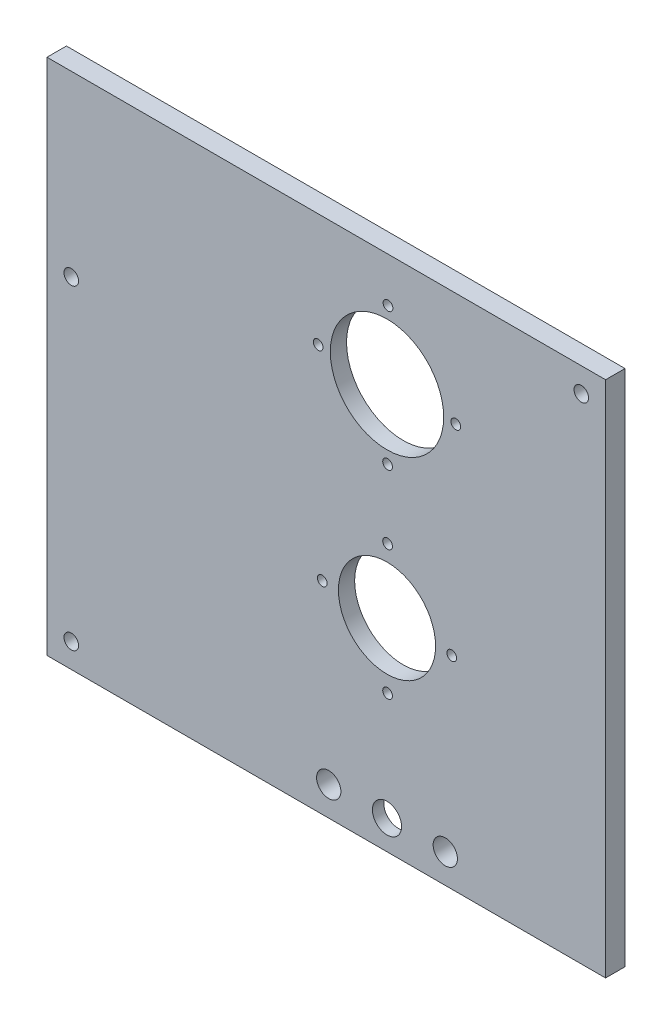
ISO-10303-21;
HEADER;
FILE_DESCRIPTION(('STEP AP214'),'2;1');
FILE_NAME('part.step','',(''),(''),'','','');
FILE_SCHEMA(('AUTOMOTIVE_DESIGN { 1 0 10303 214 1 1 1 1 }'));
ENDSEC;
DATA;
#1=APPLICATION_CONTEXT('core data for automotive mechanical design processes');
#2=APPLICATION_PROTOCOL_DEFINITION('international standard','automotive_design',2000,#1);
#3=PRODUCT_CONTEXT('',#1,'mechanical');
#4=PRODUCT('Part','Part','',(#3));
#5=PRODUCT_RELATED_PRODUCT_CATEGORY('part','',(#4));
#6=PRODUCT_DEFINITION_FORMATION('','',#4);
#7=PRODUCT_DEFINITION_CONTEXT('part definition',#1,'design');
#8=PRODUCT_DEFINITION('design','',#6,#7);
#9=PRODUCT_DEFINITION_SHAPE('','',#8);
#10=(LENGTH_UNIT() NAMED_UNIT(*) SI_UNIT(.MILLI.,.METRE.));
#11=(NAMED_UNIT(*) PLANE_ANGLE_UNIT() SI_UNIT($,.RADIAN.));
#12=(NAMED_UNIT(*) SI_UNIT($,.STERADIAN.) SOLID_ANGLE_UNIT());
#13=UNCERTAINTY_MEASURE_WITH_UNIT(LENGTH_MEASURE(1.E-05),#10,'distance_accuracy_value','');
#14=(GEOMETRIC_REPRESENTATION_CONTEXT(3) GLOBAL_UNCERTAINTY_ASSIGNED_CONTEXT((#13)) GLOBAL_UNIT_ASSIGNED_CONTEXT((#10,
#11,#12)) REPRESENTATION_CONTEXT('',''));
#15=CARTESIAN_POINT('',(0.,0.,0.));
#16=DIRECTION('',(0.,0.,1.));
#17=DIRECTION('',(1.,0.,0.));
#18=AXIS2_PLACEMENT_3D('',#15,#16,#17);
#19=CARTESIAN_POINT('',(70.,-262.,0.));
#20=DIRECTION('',(0.,0.,1.));
#21=DIRECTION('',(1.,0.,0.));
#22=AXIS2_PLACEMENT_3D('',#19,#20,#21);
#23=CYLINDRICAL_SURFACE('',#22,9.);
#24=CARTESIAN_POINT('',(70.,-262.,12.));
#25=DIRECTION('',(0.,0.,1.));
#26=DIRECTION('',(1.,0.,0.));
#27=AXIS2_PLACEMENT_3D('',#24,#25,#26);
#28=CIRCLE('',#27,9.);
#29=CARTESIAN_POINT('',(79.,-262.,12.));
#30=VERTEX_POINT('',#29);
#31=EDGE_CURVE('E195',#30,#30,#28,.T.);
#32=ORIENTED_EDGE('',*,*,#31,.T.);
#33=EDGE_LOOP('',(#32));
#34=FACE_BOUND('',#33,.T.);
#35=CARTESIAN_POINT('',(70.,-262.,5.));
#36=DIRECTION('',(0.,0.,-1.));
#37=DIRECTION('',(-1.,0.,0.));
#38=AXIS2_PLACEMENT_3D('',#35,#36,#37);
#39=CIRCLE('',#38,9.);
#40=CARTESIAN_POINT('',(61.,-262.,5.));
#41=VERTEX_POINT('',#40);
#42=EDGE_CURVE('E36',#41,#41,#39,.F.);
#43=ORIENTED_EDGE('',*,*,#42,.F.);
#44=EDGE_LOOP('',(#43));
#45=FACE_BOUND('',#44,.T.);
#46=ADVANCED_FACE('F32',(#34,#45),#23,.F.);
#47=CARTESIAN_POINT('',(70.,-155.,12.));
#48=DIRECTION('',(0.,0.,-1.));
#49=DIRECTION('',(-1.,0.,0.));
#50=AXIS2_PLACEMENT_3D('',#47,#48,#49);
#51=CYLINDRICAL_SURFACE('',#50,30.);
#52=CARTESIAN_POINT('',(70.,-155.,12.));
#53=DIRECTION('',(0.,0.,1.));
#54=DIRECTION('',(1.,0.,0.));
#55=AXIS2_PLACEMENT_3D('',#52,#53,#54);
#56=CIRCLE('',#55,30.);
#57=CARTESIAN_POINT('',(100.,-155.,12.));
#58=VERTEX_POINT('',#57);
#59=EDGE_CURVE('E232',#58,#58,#56,.T.);
#60=ORIENTED_EDGE('',*,*,#59,.T.);
#61=EDGE_LOOP('',(#60));
#62=FACE_BOUND('',#61,.T.);
#63=CARTESIAN_POINT('',(70.,-155.,2.));
#64=DIRECTION('',(0.,0.,-1.));
#65=DIRECTION('',(-1.,0.,0.));
#66=AXIS2_PLACEMENT_3D('',#63,#64,#65);
#67=CIRCLE('',#66,30.);
#68=CARTESIAN_POINT('',(40.,-155.,2.));
#69=VERTEX_POINT('',#68);
#70=EDGE_CURVE('E154',#69,#69,#67,.T.);
#71=ORIENTED_EDGE('',*,*,#70,.T.);
#72=EDGE_LOOP('',(#71));
#73=FACE_BOUND('',#72,.T.);
#74=ADVANCED_FACE('F347',(#62,#73),#51,.F.);
#75=CARTESIAN_POINT('',(70.,-30.,12.));
#76=DIRECTION('',(0.,0.,-1.));
#77=DIRECTION('',(-1.,0.,0.));
#78=AXIS2_PLACEMENT_3D('',#75,#76,#77);
#79=CYLINDRICAL_SURFACE('',#78,35.);
#80=CARTESIAN_POINT('',(70.,-30.,12.));
#81=DIRECTION('',(0.,0.,1.));
#82=DIRECTION('',(1.,0.,0.));
#83=AXIS2_PLACEMENT_3D('',#80,#81,#82);
#84=CIRCLE('',#83,35.);
#85=CARTESIAN_POINT('',(105.,-30.,12.));
#86=VERTEX_POINT('',#85);
#87=EDGE_CURVE('E229',#86,#86,#84,.T.);
#88=ORIENTED_EDGE('',*,*,#87,.T.);
#89=EDGE_LOOP('',(#88));
#90=FACE_BOUND('',#89,.T.);
#91=CARTESIAN_POINT('',(70.,-30.,2.));
#92=DIRECTION('',(0.,0.,-1.));
#93=DIRECTION('',(-1.,0.,0.));
#94=AXIS2_PLACEMENT_3D('',#91,#92,#93);
#95=CIRCLE('',#94,35.);
#96=CARTESIAN_POINT('',(35.,-30.,2.));
#97=VERTEX_POINT('',#96);
#98=EDGE_CURVE('E149',#97,#97,#95,.T.);
#99=ORIENTED_EDGE('',*,*,#98,.T.);
#100=EDGE_LOOP('',(#99));
#101=FACE_BOUND('',#100,.T.);
#102=ADVANCED_FACE('F296',(#90,#101),#79,.F.);
#103=CARTESIAN_POINT('',(-140.,40.,12.));
#104=DIRECTION('',(0.,0.,-1.));
#105=DIRECTION('',(-1.,0.,0.));
#106=AXIS2_PLACEMENT_3D('',#103,#104,#105);
#107=PLANE('',#106);
#108=CARTESIAN_POINT('',(106.,-262.,12.));
#109=DIRECTION('',(0.,0.,1.));
#110=DIRECTION('',(1.,0.,0.));
#111=AXIS2_PLACEMENT_3D('',#108,#109,#110);
#112=CIRCLE('',#111,7.50000000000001);
#113=CARTESIAN_POINT('',(113.5,-262.,12.));
#114=VERTEX_POINT('',#113);
#115=EDGE_CURVE('E268',#114,#114,#112,.T.);
#116=ORIENTED_EDGE('',*,*,#115,.F.);
#117=EDGE_LOOP('',(#116));
#118=FACE_BOUND('',#117,.T.);
#119=CARTESIAN_POINT('',(34.,-262.,12.));
#120=DIRECTION('',(0.,0.,1.));
#121=DIRECTION('',(1.,0.,0.));
#122=AXIS2_PLACEMENT_3D('',#119,#120,#121);
#123=CIRCLE('',#122,7.5);
#124=CARTESIAN_POINT('',(41.5,-262.,12.));
#125=VERTEX_POINT('',#124);
#126=EDGE_CURVE('E279',#125,#125,#123,.T.);
#127=ORIENTED_EDGE('',*,*,#126,.F.);
#128=EDGE_LOOP('',(#127));
#129=FACE_BOUND('',#128,.T.);
#130=ORIENTED_EDGE('',*,*,#31,.F.);
#131=EDGE_LOOP('',(#130));
#132=FACE_BOUND('',#131,.T.);
#133=CARTESIAN_POINT('',(70.6097344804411,12.5,12.));
#134=DIRECTION('',(0.,0.,1.));
#135=DIRECTION('',(1.,0.,0.));
#136=AXIS2_PLACEMENT_3D('',#133,#134,#135);
#137=CIRCLE('',#136,2.99999999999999);
#138=CARTESIAN_POINT('',(73.6097344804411,12.5,12.));
#139=VERTEX_POINT('',#138);
#140=EDGE_CURVE('E189',#139,#139,#137,.T.);
#141=ORIENTED_EDGE('',*,*,#140,.F.);
#142=EDGE_LOOP('',(#141));
#143=FACE_BOUND('',#142,.T.);
#144=CARTESIAN_POINT('',(70.358898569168,-72.5,12.));
#145=DIRECTION('',(0.,0.,1.));
#146=DIRECTION('',(1.,0.,0.));
#147=AXIS2_PLACEMENT_3D('',#144,#145,#146);
#148=CIRCLE('',#147,2.99999999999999);
#149=CARTESIAN_POINT('',(73.358898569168,-72.5,12.));
#150=VERTEX_POINT('',#149);
#151=EDGE_CURVE('E186',#150,#150,#148,.T.);
#152=ORIENTED_EDGE('',*,*,#151,.F.);
#153=EDGE_LOOP('',(#152));
#154=FACE_BOUND('',#153,.T.);
#155=CARTESIAN_POINT('',(112.5,-30.,12.));
#156=DIRECTION('',(0.,0.,1.));
#157=DIRECTION('',(1.,0.,0.));
#158=AXIS2_PLACEMENT_3D('',#155,#156,#157);
#159=CIRCLE('',#158,2.99999999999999);
#160=CARTESIAN_POINT('',(115.5,-30.,12.));
#161=VERTEX_POINT('',#160);
#162=EDGE_CURVE('E183',#161,#161,#159,.T.);
#163=ORIENTED_EDGE('',*,*,#162,.F.);
#164=EDGE_LOOP('',(#163));
#165=FACE_BOUND('',#164,.T.);
#166=CARTESIAN_POINT('',(27.5,-30.,12.));
#167=DIRECTION('',(0.,0.,1.));
#168=DIRECTION('',(1.,0.,0.));
#169=AXIS2_PLACEMENT_3D('',#166,#167,#168);
#170=CIRCLE('',#169,2.99999999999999);
#171=CARTESIAN_POINT('',(30.5,-30.,12.));
#172=VERTEX_POINT('',#171);
#173=EDGE_CURVE('E179',#172,#172,#170,.T.);
#174=ORIENTED_EDGE('',*,*,#173,.F.);
#175=EDGE_LOOP('',(#174));
#176=FACE_BOUND('',#175,.T.);
#177=CARTESIAN_POINT('',(110.,-155.,12.));
#178=DIRECTION('',(0.,0.,1.));
#179=DIRECTION('',(1.,0.,0.));
#180=AXIS2_PLACEMENT_3D('',#177,#178,#179);
#181=CIRCLE('',#180,2.99999999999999);
#182=CARTESIAN_POINT('',(113.,-155.,12.));
#183=VERTEX_POINT('',#182);
#184=EDGE_CURVE('E175',#183,#183,#181,.T.);
#185=ORIENTED_EDGE('',*,*,#184,.F.);
#186=EDGE_LOOP('',(#185));
#187=FACE_BOUND('',#186,.T.);
#188=CARTESIAN_POINT('',(70.358898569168,-195.,12.));
#189=DIRECTION('',(0.,0.,1.));
#190=DIRECTION('',(1.,0.,0.));
#191=AXIS2_PLACEMENT_3D('',#188,#189,#190);
#192=CIRCLE('',#191,2.99999999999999);
#193=CARTESIAN_POINT('',(73.358898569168,-195.,12.));
#194=VERTEX_POINT('',#193);
#195=EDGE_CURVE('E171',#194,#194,#192,.T.);
#196=ORIENTED_EDGE('',*,*,#195,.F.);
#197=EDGE_LOOP('',(#196));
#198=FACE_BOUND('',#197,.T.);
#199=CARTESIAN_POINT('',(30.,-155.,12.));
#200=DIRECTION('',(0.,0.,1.));
#201=DIRECTION('',(1.,0.,0.));
#202=AXIS2_PLACEMENT_3D('',#199,#200,#201);
#203=CIRCLE('',#202,2.99999999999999);
#204=CARTESIAN_POINT('',(33.,-155.,12.));
#205=VERTEX_POINT('',#204);
#206=EDGE_CURVE('E167',#205,#205,#203,.T.);
#207=ORIENTED_EDGE('',*,*,#206,.F.);
#208=EDGE_LOOP('',(#207));
#209=FACE_BOUND('',#208,.T.);
#210=CARTESIAN_POINT('',(70.358898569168,-115.,12.));
#211=DIRECTION('',(0.,0.,1.));
#212=DIRECTION('',(1.,0.,0.));
#213=AXIS2_PLACEMENT_3D('',#210,#211,#212);
#214=CIRCLE('',#213,2.99999999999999);
#215=CARTESIAN_POINT('',(73.358898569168,-115.,12.));
#216=VERTEX_POINT('',#215);
#217=EDGE_CURVE('E163',#216,#216,#214,.T.);
#218=ORIENTED_EDGE('',*,*,#217,.F.);
#219=EDGE_LOOP('',(#218));
#220=FACE_BOUND('',#219,.T.);
#221=ORIENTED_EDGE('',*,*,#87,.F.);
#222=EDGE_LOOP('',(#221));
#223=FACE_BOUND('',#222,.T.);
#224=CARTESIAN_POINT('',(-125.,-265.,12.));
#225=DIRECTION('',(0.,0.,1.));
#226=DIRECTION('',(1.,0.,0.));
#227=AXIS2_PLACEMENT_3D('',#224,#225,#226);
#228=CIRCLE('',#227,4.50000000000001);
#229=CARTESIAN_POINT('',(-120.5,-265.,12.));
#230=VERTEX_POINT('',#229);
#231=EDGE_CURVE('E238',#230,#230,#228,.T.);
#232=ORIENTED_EDGE('',*,*,#231,.F.);
#233=EDGE_LOOP('',(#232));
#234=FACE_BOUND('',#233,.T.);
#235=DIRECTION('',(-1.,0.,0.));
#236=VECTOR('',#235,1.);
#237=CARTESIAN_POINT('',(-140.,40.,12.));
#238=LINE('',#237,#236);
#239=CARTESIAN_POINT('',(205.,40.,12.));
#240=VERTEX_POINT('',#239);
#241=CARTESIAN_POINT('',(-140.,40.,12.));
#242=VERTEX_POINT('',#241);
#243=EDGE_CURVE('E130',#240,#242,#238,.T.);
#244=ORIENTED_EDGE('',*,*,#243,.T.);
#245=DIRECTION('',(0.,-1.,0.));
#246=VECTOR('',#245,1.);
#247=CARTESIAN_POINT('',(-140.,40.,12.));
#248=LINE('',#247,#246);
#249=CARTESIAN_POINT('',(-140.,-280.,12.));
#250=VERTEX_POINT('',#249);
#251=EDGE_CURVE('E137',#242,#250,#248,.T.);
#252=ORIENTED_EDGE('',*,*,#251,.T.);
#253=DIRECTION('',(1.,0.,0.));
#254=VECTOR('',#253,1.);
#255=CARTESIAN_POINT('',(-140.,-280.,12.));
#256=LINE('',#255,#254);
#257=CARTESIAN_POINT('',(205.,-280.,12.));
#258=VERTEX_POINT('',#257);
#259=EDGE_CURVE('E139',#250,#258,#256,.T.);
#260=ORIENTED_EDGE('',*,*,#259,.T.);
#261=DIRECTION('',(0.,1.,0.));
#262=VECTOR('',#261,1.);
#263=CARTESIAN_POINT('',(205.,40.,12.));
#264=LINE('',#263,#262);
#265=EDGE_CURVE('E57',#258,#240,#264,.T.);
#266=ORIENTED_EDGE('',*,*,#265,.T.);
#267=EDGE_LOOP('',(#244,#252,#260,#266));
#268=FACE_BOUND('',#267,.T.);
#269=CARTESIAN_POINT('',(190.,25.,12.));
#270=DIRECTION('',(0.,0.,1.));
#271=DIRECTION('',(1.,0.,0.));
#272=AXIS2_PLACEMENT_3D('',#269,#270,#271);
#273=CIRCLE('',#272,4.49999999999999);
#274=CARTESIAN_POINT('',(194.5,25.,12.));
#275=VERTEX_POINT('',#274);
#276=EDGE_CURVE('E244',#275,#275,#273,.T.);
#277=ORIENTED_EDGE('',*,*,#276,.F.);
#278=EDGE_LOOP('',(#277));
#279=FACE_BOUND('',#278,.T.);
#280=ORIENTED_EDGE('',*,*,#59,.F.);
#281=EDGE_LOOP('',(#280));
#282=FACE_BOUND('',#281,.T.);
#283=CARTESIAN_POINT('',(-125.,-70.,12.));
#284=DIRECTION('',(0.,0.,1.));
#285=DIRECTION('',(1.,0.,0.));
#286=AXIS2_PLACEMENT_3D('',#283,#284,#285);
#287=CIRCLE('',#286,4.50000000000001);
#288=CARTESIAN_POINT('',(-120.5,-70.,12.));
#289=VERTEX_POINT('',#288);
#290=EDGE_CURVE('E226',#289,#289,#287,.T.);
#291=ORIENTED_EDGE('',*,*,#290,.F.);
#292=EDGE_LOOP('',(#291));
#293=FACE_BOUND('',#292,.T.);
#294=ADVANCED_FACE('F259',(#118,#129,#132,#143,#154,#165,#176,#187,#198,#209,#220,#223,#234,
#268,#279,#282,#293),#107,.F.);
#295=CARTESIAN_POINT('',(-140.,40.,0.));
#296=DIRECTION('',(0.,0.,-1.));
#297=DIRECTION('',(-1.,0.,0.));
#298=AXIS2_PLACEMENT_3D('',#295,#296,#297);
#299=PLANE('',#298);
#300=DIRECTION('',(0.,-1.,0.));
#301=VECTOR('',#300,1.);
#302=CARTESIAN_POINT('',(88.,-262.,0.));
#303=LINE('',#302,#301);
#304=CARTESIAN_POINT('',(88.,-262.,0.));
#305=VERTEX_POINT('',#304);
#306=CARTESIAN_POINT('',(88.,-280.,0.));
#307=VERTEX_POINT('',#306);
#308=EDGE_CURVE('E617',#305,#307,#303,.T.);
#309=ORIENTED_EDGE('',*,*,#308,.F.);
#310=CARTESIAN_POINT('',(70.,-262.,0.));
#311=DIRECTION('',(0.,0.,-1.));
#312=DIRECTION('',(-1.,0.,0.));
#313=AXIS2_PLACEMENT_3D('',#310,#311,#312);
#314=CIRCLE('',#313,18.);
#315=CARTESIAN_POINT('',(52.,-262.,0.));
#316=VERTEX_POINT('',#315);
#317=EDGE_CURVE('E121',#316,#305,#314,.T.);
#318=ORIENTED_EDGE('',*,*,#317,.F.);
#319=DIRECTION('',(0.,1.,0.));
#320=VECTOR('',#319,1.);
#321=CARTESIAN_POINT('',(52.,-262.,0.));
#322=LINE('',#321,#320);
#323=CARTESIAN_POINT('',(52.,-280.,0.));
#324=VERTEX_POINT('',#323);
#325=EDGE_CURVE('E105',#324,#316,#322,.T.);
#326=ORIENTED_EDGE('',*,*,#325,.F.);
#327=DIRECTION('',(1.,0.,0.));
#328=VECTOR('',#327,1.);
#329=CARTESIAN_POINT('',(-140.,-280.,0.));
#330=LINE('',#329,#328);
#331=CARTESIAN_POINT('',(-140.,-280.,0.));
#332=VERTEX_POINT('',#331);
#333=EDGE_CURVE('E119',#332,#324,#330,.T.);
#334=ORIENTED_EDGE('',*,*,#333,.F.);
#335=DIRECTION('',(0.,-1.,0.));
#336=VECTOR('',#335,1.);
#337=CARTESIAN_POINT('',(-140.,40.,0.));
#338=LINE('',#337,#336);
#339=CARTESIAN_POINT('',(-140.,40.,0.));
#340=VERTEX_POINT('',#339);
#341=EDGE_CURVE('E132',#340,#332,#338,.T.);
#342=ORIENTED_EDGE('',*,*,#341,.F.);
#343=DIRECTION('',(-1.,0.,0.));
#344=VECTOR('',#343,1.);
#345=CARTESIAN_POINT('',(-140.,40.,0.));
#346=LINE('',#345,#344);
#347=CARTESIAN_POINT('',(205.,40.,0.));
#348=VERTEX_POINT('',#347);
#349=EDGE_CURVE('E246',#348,#340,#346,.T.);
#350=ORIENTED_EDGE('',*,*,#349,.F.);
#351=DIRECTION('',(0.,1.,0.));
#352=VECTOR('',#351,1.);
#353=CARTESIAN_POINT('',(205.,40.,0.));
#354=LINE('',#353,#352);
#355=CARTESIAN_POINT('',(205.,-280.,0.));
#356=VERTEX_POINT('',#355);
#357=EDGE_CURVE('E127',#356,#348,#354,.T.);
#358=ORIENTED_EDGE('',*,*,#357,.F.);
#359=EDGE_CURVE('E128',#307,#356,#330,.T.);
#360=ORIENTED_EDGE('',*,*,#359,.F.);
#361=EDGE_LOOP('',(#309,#318,#326,#334,#342,#350,#358,#360));
#362=FACE_BOUND('',#361,.T.);
#363=CARTESIAN_POINT('',(106.,-262.,0.));
#364=DIRECTION('',(0.,0.,1.));
#365=DIRECTION('',(1.,0.,0.));
#366=AXIS2_PLACEMENT_3D('',#363,#364,#365);
#367=CIRCLE('',#366,7.50000000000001);
#368=CARTESIAN_POINT('',(113.5,-262.,0.));
#369=VERTEX_POINT('',#368);
#370=EDGE_CURVE('E276',#369,#369,#367,.T.);
#371=ORIENTED_EDGE('',*,*,#370,.T.);
#372=EDGE_LOOP('',(#371));
#373=FACE_BOUND('',#372,.T.);
#374=CARTESIAN_POINT('',(34.,-262.,0.));
#375=DIRECTION('',(0.,0.,1.));
#376=DIRECTION('',(1.,0.,0.));
#377=AXIS2_PLACEMENT_3D('',#374,#375,#376);
#378=CIRCLE('',#377,7.5);
#379=CARTESIAN_POINT('',(41.5,-262.,0.));
#380=VERTEX_POINT('',#379);
#381=EDGE_CURVE('E200',#380,#380,#378,.T.);
#382=ORIENTED_EDGE('',*,*,#381,.T.);
#383=EDGE_LOOP('',(#382));
#384=FACE_BOUND('',#383,.T.);
#385=CARTESIAN_POINT('',(70.,-155.,0.));
#386=DIRECTION('',(0.,0.,-1.));
#387=DIRECTION('',(-1.,0.,0.));
#388=AXIS2_PLACEMENT_3D('',#385,#386,#387);
#389=CIRCLE('',#388,47.5);
#390=CARTESIAN_POINT('',(22.5,-155.,0.));
#391=VERTEX_POINT('',#390);
#392=EDGE_CURVE('E162',#391,#391,#389,.T.);
#393=ORIENTED_EDGE('',*,*,#392,.F.);
#394=EDGE_LOOP('',(#393));
#395=FACE_BOUND('',#394,.T.);
#396=CARTESIAN_POINT('',(70.,-30.,0.));
#397=DIRECTION('',(0.,0.,-1.));
#398=DIRECTION('',(-1.,0.,0.));
#399=AXIS2_PLACEMENT_3D('',#396,#397,#398);
#400=CIRCLE('',#399,55.);
#401=CARTESIAN_POINT('',(15.,-30.,0.));
#402=VERTEX_POINT('',#401);
#403=EDGE_CURVE('E157',#402,#402,#400,.T.);
#404=ORIENTED_EDGE('',*,*,#403,.F.);
#405=EDGE_LOOP('',(#404));
#406=FACE_BOUND('',#405,.T.);
#407=CARTESIAN_POINT('',(-125.,-265.,0.));
#408=DIRECTION('',(0.,0.,1.));
#409=DIRECTION('',(1.,0.,0.));
#410=AXIS2_PLACEMENT_3D('',#407,#408,#409);
#411=CIRCLE('',#410,4.50000000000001);
#412=CARTESIAN_POINT('',(-120.5,-265.,0.));
#413=VERTEX_POINT('',#412);
#414=EDGE_CURVE('E235',#413,#413,#411,.T.);
#415=ORIENTED_EDGE('',*,*,#414,.T.);
#416=EDGE_LOOP('',(#415));
#417=FACE_BOUND('',#416,.T.);
#418=CARTESIAN_POINT('',(190.,25.,0.));
#419=DIRECTION('',(0.,0.,1.));
#420=DIRECTION('',(1.,0.,0.));
#421=AXIS2_PLACEMENT_3D('',#418,#419,#420);
#422=CIRCLE('',#421,4.49999999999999);
#423=CARTESIAN_POINT('',(194.5,25.,0.));
#424=VERTEX_POINT('',#423);
#425=EDGE_CURVE('E241',#424,#424,#422,.T.);
#426=ORIENTED_EDGE('',*,*,#425,.T.);
#427=EDGE_LOOP('',(#426));
#428=FACE_BOUND('',#427,.T.);
#429=CARTESIAN_POINT('',(-125.,-70.,0.));
#430=DIRECTION('',(0.,0.,1.));
#431=DIRECTION('',(1.,0.,0.));
#432=AXIS2_PLACEMENT_3D('',#429,#430,#431);
#433=CIRCLE('',#432,4.50000000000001);
#434=CARTESIAN_POINT('',(-120.5,-70.,0.));
#435=VERTEX_POINT('',#434);
#436=EDGE_CURVE('E152',#435,#435,#433,.T.);
#437=ORIENTED_EDGE('',*,*,#436,.T.);
#438=EDGE_LOOP('',(#437));
#439=FACE_BOUND('',#438,.T.);
#440=ADVANCED_FACE('F117',(#362,#373,#384,#395,#406,#417,#428,#439),#299,.T.);
#441=CARTESIAN_POINT('',(-140.,40.,12.));
#442=DIRECTION('',(0.,-1.,0.));
#443=DIRECTION('',(0.,0.,-1.));
#444=AXIS2_PLACEMENT_3D('',#441,#442,#443);
#445=PLANE('',#444);
#446=ORIENTED_EDGE('',*,*,#349,.T.);
#447=DIRECTION('',(0.,0.,-1.));
#448=VECTOR('',#447,1.);
#449=CARTESIAN_POINT('',(-140.,40.,12.));
#450=LINE('',#449,#448);
#451=EDGE_CURVE('E11',#242,#340,#450,.T.);
#452=ORIENTED_EDGE('',*,*,#451,.F.);
#453=ORIENTED_EDGE('',*,*,#243,.F.);
#454=DIRECTION('',(0.,0.,-1.));
#455=VECTOR('',#454,1.);
#456=CARTESIAN_POINT('',(205.,40.,12.));
#457=LINE('',#456,#455);
#458=EDGE_CURVE('E142',#240,#348,#457,.T.);
#459=ORIENTED_EDGE('',*,*,#458,.T.);
#460=EDGE_LOOP('',(#446,#452,#453,#459));
#461=FACE_BOUND('',#460,.T.);
#462=ADVANCED_FACE('F34',(#461),#445,.F.);
#463=CARTESIAN_POINT('',(-140.,40.,12.));
#464=DIRECTION('',(1.,0.,0.));
#465=DIRECTION('',(0.,1.,0.));
#466=AXIS2_PLACEMENT_3D('',#463,#464,#465);
#467=PLANE('',#466);
#468=ORIENTED_EDGE('',*,*,#341,.T.);
#469=DIRECTION('',(0.,0.,-1.));
#470=VECTOR('',#469,1.);
#471=CARTESIAN_POINT('',(-140.,-280.,12.));
#472=LINE('',#471,#470);
#473=EDGE_CURVE('E41',#250,#332,#472,.T.);
#474=ORIENTED_EDGE('',*,*,#473,.F.);
#475=ORIENTED_EDGE('',*,*,#251,.F.);
#476=ORIENTED_EDGE('',*,*,#451,.T.);
#477=EDGE_LOOP('',(#468,#474,#475,#476));
#478=FACE_BOUND('',#477,.T.);
#479=ADVANCED_FACE('F252',(#478),#467,.F.);
#480=CARTESIAN_POINT('',(-140.,-280.,12.));
#481=DIRECTION('',(0.,1.,0.));
#482=DIRECTION('',(0.,0.,1.));
#483=AXIS2_PLACEMENT_3D('',#480,#481,#482);
#484=PLANE('',#483);
#485=DIRECTION('',(-1.,0.,0.));
#486=VECTOR('',#485,1.);
#487=CARTESIAN_POINT('',(88.,-280.,5.));
#488=LINE('',#487,#486);
#489=CARTESIAN_POINT('',(88.,-280.,5.));
#490=VERTEX_POINT('',#489);
#491=CARTESIAN_POINT('',(52.,-280.,5.));
#492=VERTEX_POINT('',#491);
#493=EDGE_CURVE('E263',#490,#492,#488,.T.);
#494=ORIENTED_EDGE('',*,*,#493,.F.);
#495=DIRECTION('',(0.,0.,-1.));
#496=VECTOR('',#495,1.);
#497=CARTESIAN_POINT('',(88.,-280.,5.));
#498=LINE('',#497,#496);
#499=EDGE_CURVE('E262',#490,#307,#498,.T.);
#500=ORIENTED_EDGE('',*,*,#499,.T.);
#501=ORIENTED_EDGE('',*,*,#359,.T.);
#502=DIRECTION('',(0.,0.,-1.));
#503=VECTOR('',#502,1.);
#504=CARTESIAN_POINT('',(205.,-280.,12.));
#505=LINE('',#504,#503);
#506=EDGE_CURVE('E145',#258,#356,#505,.T.);
#507=ORIENTED_EDGE('',*,*,#506,.F.);
#508=ORIENTED_EDGE('',*,*,#259,.F.);
#509=ORIENTED_EDGE('',*,*,#473,.T.);
#510=ORIENTED_EDGE('',*,*,#333,.T.);
#511=DIRECTION('',(0.,0.,-1.));
#512=VECTOR('',#511,1.);
#513=CARTESIAN_POINT('',(52.,-280.,5.));
#514=LINE('',#513,#512);
#515=EDGE_CURVE('E102',#492,#324,#514,.T.);
#516=ORIENTED_EDGE('',*,*,#515,.F.);
#517=EDGE_LOOP('',(#494,#500,#501,#507,#508,#509,#510,#516));
#518=FACE_BOUND('',#517,.T.);
#519=ADVANCED_FACE('F124',(#518),#484,.F.);
#520=CARTESIAN_POINT('',(205.,40.,12.));
#521=DIRECTION('',(-1.,0.,0.));
#522=DIRECTION('',(0.,-1.,0.));
#523=AXIS2_PLACEMENT_3D('',#520,#521,#522);
#524=PLANE('',#523);
#525=ORIENTED_EDGE('',*,*,#357,.T.);
#526=ORIENTED_EDGE('',*,*,#458,.F.);
#527=ORIENTED_EDGE('',*,*,#265,.F.);
#528=ORIENTED_EDGE('',*,*,#506,.T.);
#529=EDGE_LOOP('',(#525,#526,#527,#528));
#530=FACE_BOUND('',#529,.T.);
#531=ADVANCED_FACE('F256',(#530),#524,.F.);
#532=CARTESIAN_POINT('',(190.,25.,12.));
#533=DIRECTION('',(0.,0.,-1.));
#534=DIRECTION('',(-1.,0.,0.));
#535=AXIS2_PLACEMENT_3D('',#532,#533,#534);
#536=CYLINDRICAL_SURFACE('',#535,4.49999999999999);
#537=ORIENTED_EDGE('',*,*,#276,.T.);
#538=EDGE_LOOP('',(#537));
#539=FACE_BOUND('',#538,.T.);
#540=ORIENTED_EDGE('',*,*,#425,.F.);
#541=EDGE_LOOP('',(#540));
#542=FACE_BOUND('',#541,.T.);
#543=ADVANCED_FACE('F324',(#539,#542),#536,.F.);
#544=CARTESIAN_POINT('',(-125.,-265.,12.));
#545=DIRECTION('',(0.,0.,-1.));
#546=DIRECTION('',(-1.,0.,0.));
#547=AXIS2_PLACEMENT_3D('',#544,#545,#546);
#548=CYLINDRICAL_SURFACE('',#547,4.50000000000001);
#549=ORIENTED_EDGE('',*,*,#231,.T.);
#550=EDGE_LOOP('',(#549));
#551=FACE_BOUND('',#550,.T.);
#552=ORIENTED_EDGE('',*,*,#414,.F.);
#553=EDGE_LOOP('',(#552));
#554=FACE_BOUND('',#553,.T.);
#555=ADVANCED_FACE('F320',(#551,#554),#548,.F.);
#556=CARTESIAN_POINT('',(-125.,-70.,12.));
#557=DIRECTION('',(0.,0.,-1.));
#558=DIRECTION('',(-1.,0.,0.));
#559=AXIS2_PLACEMENT_3D('',#556,#557,#558);
#560=CYLINDRICAL_SURFACE('',#559,4.50000000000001);
#561=ORIENTED_EDGE('',*,*,#290,.T.);
#562=EDGE_LOOP('',(#561));
#563=FACE_BOUND('',#562,.T.);
#564=ORIENTED_EDGE('',*,*,#436,.F.);
#565=EDGE_LOOP('',(#564));
#566=FACE_BOUND('',#565,.T.);
#567=ADVANCED_FACE('F323',(#563,#566),#560,.F.);
#568=CARTESIAN_POINT('',(70.,-30.,2.));
#569=DIRECTION('',(0.,0.,-1.));
#570=DIRECTION('',(-1.,0.,0.));
#571=AXIS2_PLACEMENT_3D('',#568,#569,#570);
#572=CYLINDRICAL_SURFACE('',#571,55.);
#573=CARTESIAN_POINT('',(70.,-30.,2.));
#574=DIRECTION('',(0.,0.,-1.));
#575=DIRECTION('',(-1.,0.,0.));
#576=AXIS2_PLACEMENT_3D('',#573,#574,#575);
#577=CIRCLE('',#576,55.);
#578=CARTESIAN_POINT('',(15.,-30.,2.));
#579=VERTEX_POINT('',#578);
#580=EDGE_CURVE('E153',#579,#579,#577,.T.);
#581=ORIENTED_EDGE('',*,*,#580,.F.);
#582=EDGE_LOOP('',(#581));
#583=FACE_BOUND('',#582,.T.);
#584=ORIENTED_EDGE('',*,*,#403,.T.);
#585=EDGE_LOOP('',(#584));
#586=FACE_BOUND('',#585,.T.);
#587=ADVANCED_FACE('F336',(#583,#586),#572,.F.);
#588=CARTESIAN_POINT('',(70.,-30.,2.));
#589=DIRECTION('',(0.,0.,-1.));
#590=DIRECTION('',(-1.,0.,0.));
#591=AXIS2_PLACEMENT_3D('',#588,#589,#590);
#592=PLANE('',#591);
#593=CARTESIAN_POINT('',(70.6097344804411,12.5,2.));
#594=DIRECTION('',(0.,0.,-1.));
#595=DIRECTION('',(-1.,0.,0.));
#596=AXIS2_PLACEMENT_3D('',#593,#594,#595);
#597=CIRCLE('',#596,3.);
#598=CARTESIAN_POINT('',(67.6097344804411,12.5,2.));
#599=VERTEX_POINT('',#598);
#600=EDGE_CURVE('E187',#599,#599,#597,.T.);
#601=ORIENTED_EDGE('',*,*,#600,.F.);
#602=EDGE_LOOP('',(#601));
#603=FACE_BOUND('',#602,.T.);
#604=CARTESIAN_POINT('',(70.358898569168,-72.5,2.));
#605=DIRECTION('',(0.,0.,-1.));
#606=DIRECTION('',(-1.,0.,0.));
#607=AXIS2_PLACEMENT_3D('',#604,#605,#606);
#608=CIRCLE('',#607,3.);
#609=CARTESIAN_POINT('',(67.358898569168,-72.5,2.));
#610=VERTEX_POINT('',#609);
#611=EDGE_CURVE('E184',#610,#610,#608,.T.);
#612=ORIENTED_EDGE('',*,*,#611,.F.);
#613=EDGE_LOOP('',(#612));
#614=FACE_BOUND('',#613,.T.);
#615=CARTESIAN_POINT('',(112.5,-30.,2.));
#616=DIRECTION('',(0.,0.,-1.));
#617=DIRECTION('',(-1.,0.,0.));
#618=AXIS2_PLACEMENT_3D('',#615,#616,#617);
#619=CIRCLE('',#618,3.);
#620=CARTESIAN_POINT('',(109.5,-30.,2.));
#621=VERTEX_POINT('',#620);
#622=EDGE_CURVE('E180',#621,#621,#619,.T.);
#623=ORIENTED_EDGE('',*,*,#622,.F.);
#624=EDGE_LOOP('',(#623));
#625=FACE_BOUND('',#624,.T.);
#626=CARTESIAN_POINT('',(27.5,-30.,2.));
#627=DIRECTION('',(0.,0.,-1.));
#628=DIRECTION('',(-1.,0.,0.));
#629=AXIS2_PLACEMENT_3D('',#626,#627,#628);
#630=CIRCLE('',#629,2.99999999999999);
#631=CARTESIAN_POINT('',(24.5,-30.,2.));
#632=VERTEX_POINT('',#631);
#633=EDGE_CURVE('E176',#632,#632,#630,.T.);
#634=ORIENTED_EDGE('',*,*,#633,.F.);
#635=EDGE_LOOP('',(#634));
#636=FACE_BOUND('',#635,.T.);
#637=ORIENTED_EDGE('',*,*,#98,.F.);
#638=EDGE_LOOP('',(#637));
#639=FACE_BOUND('',#638,.T.);
#640=ORIENTED_EDGE('',*,*,#580,.T.);
#641=EDGE_LOOP('',(#640));
#642=FACE_BOUND('',#641,.T.);
#643=ADVANCED_FACE('F342',(#603,#614,#625,#636,#639,#642),#592,.T.);
#644=CARTESIAN_POINT('',(70.,-155.,2.));
#645=DIRECTION('',(0.,0.,-1.));
#646=DIRECTION('',(-1.,0.,0.));
#647=AXIS2_PLACEMENT_3D('',#644,#645,#646);
#648=CYLINDRICAL_SURFACE('',#647,47.5);
#649=CARTESIAN_POINT('',(70.,-155.,2.));
#650=DIRECTION('',(0.,0.,-1.));
#651=DIRECTION('',(-1.,0.,0.));
#652=AXIS2_PLACEMENT_3D('',#649,#650,#651);
#653=CIRCLE('',#652,47.5);
#654=CARTESIAN_POINT('',(22.5,-155.,2.));
#655=VERTEX_POINT('',#654);
#656=EDGE_CURVE('E158',#655,#655,#653,.T.);
#657=ORIENTED_EDGE('',*,*,#656,.F.);
#658=EDGE_LOOP('',(#657));
#659=FACE_BOUND('',#658,.T.);
#660=ORIENTED_EDGE('',*,*,#392,.T.);
#661=EDGE_LOOP('',(#660));
#662=FACE_BOUND('',#661,.T.);
#663=ADVANCED_FACE('F391',(#659,#662),#648,.F.);
#664=CARTESIAN_POINT('',(70.,-155.,2.));
#665=DIRECTION('',(0.,0.,-1.));
#666=DIRECTION('',(-1.,0.,0.));
#667=AXIS2_PLACEMENT_3D('',#664,#665,#666);
#668=PLANE('',#667);
#669=CARTESIAN_POINT('',(110.,-155.,2.));
#670=DIRECTION('',(0.,0.,-1.));
#671=DIRECTION('',(-1.,0.,0.));
#672=AXIS2_PLACEMENT_3D('',#669,#670,#671);
#673=CIRCLE('',#672,3.);
#674=CARTESIAN_POINT('',(107.,-155.,2.));
#675=VERTEX_POINT('',#674);
#676=EDGE_CURVE('E172',#675,#675,#673,.T.);
#677=ORIENTED_EDGE('',*,*,#676,.F.);
#678=EDGE_LOOP('',(#677));
#679=FACE_BOUND('',#678,.T.);
#680=CARTESIAN_POINT('',(70.358898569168,-195.,2.));
#681=DIRECTION('',(0.,0.,-1.));
#682=DIRECTION('',(-1.,0.,0.));
#683=AXIS2_PLACEMENT_3D('',#680,#681,#682);
#684=CIRCLE('',#683,3.);
#685=CARTESIAN_POINT('',(67.358898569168,-195.,2.));
#686=VERTEX_POINT('',#685);
#687=EDGE_CURVE('E168',#686,#686,#684,.T.);
#688=ORIENTED_EDGE('',*,*,#687,.F.);
#689=EDGE_LOOP('',(#688));
#690=FACE_BOUND('',#689,.T.);
#691=CARTESIAN_POINT('',(30.,-155.,2.));
#692=DIRECTION('',(0.,0.,-1.));
#693=DIRECTION('',(-1.,0.,0.));
#694=AXIS2_PLACEMENT_3D('',#691,#692,#693);
#695=CIRCLE('',#694,2.99999999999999);
#696=CARTESIAN_POINT('',(27.,-155.,2.));
#697=VERTEX_POINT('',#696);
#698=EDGE_CURVE('E164',#697,#697,#695,.T.);
#699=ORIENTED_EDGE('',*,*,#698,.F.);
#700=EDGE_LOOP('',(#699));
#701=FACE_BOUND('',#700,.T.);
#702=CARTESIAN_POINT('',(70.358898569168,-115.,2.));
#703=DIRECTION('',(0.,0.,-1.));
#704=DIRECTION('',(-1.,0.,0.));
#705=AXIS2_PLACEMENT_3D('',#702,#703,#704);
#706=CIRCLE('',#705,3.);
#707=CARTESIAN_POINT('',(67.358898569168,-115.,2.));
#708=VERTEX_POINT('',#707);
#709=EDGE_CURVE('E159',#708,#708,#706,.T.);
#710=ORIENTED_EDGE('',*,*,#709,.F.);
#711=EDGE_LOOP('',(#710));
#712=FACE_BOUND('',#711,.T.);
#713=ORIENTED_EDGE('',*,*,#70,.F.);
#714=EDGE_LOOP('',(#713));
#715=FACE_BOUND('',#714,.T.);
#716=ORIENTED_EDGE('',*,*,#656,.T.);
#717=EDGE_LOOP('',(#716));
#718=FACE_BOUND('',#717,.T.);
#719=ADVANCED_FACE('F387',(#679,#690,#701,#712,#715,#718),#668,.T.);
#720=CARTESIAN_POINT('',(70.358898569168,-115.,12.));
#721=DIRECTION('',(0.,0.,1.));
#722=DIRECTION('',(1.,0.,0.));
#723=AXIS2_PLACEMENT_3D('',#720,#721,#722);
#724=CYLINDRICAL_SURFACE('',#723,3.);
#725=ORIENTED_EDGE('',*,*,#709,.T.);
#726=EDGE_LOOP('',(#725));
#727=FACE_BOUND('',#726,.T.);
#728=ORIENTED_EDGE('',*,*,#217,.T.);
#729=EDGE_LOOP('',(#728));
#730=FACE_BOUND('',#729,.T.);
#731=ADVANCED_FACE('F383',(#727,#730),#724,.F.);
#732=CARTESIAN_POINT('',(30.,-155.,12.));
#733=DIRECTION('',(0.,0.,1.));
#734=DIRECTION('',(1.,0.,0.));
#735=AXIS2_PLACEMENT_3D('',#732,#733,#734);
#736=CYLINDRICAL_SURFACE('',#735,2.99999999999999);
#737=ORIENTED_EDGE('',*,*,#698,.T.);
#738=EDGE_LOOP('',(#737));
#739=FACE_BOUND('',#738,.T.);
#740=ORIENTED_EDGE('',*,*,#206,.T.);
#741=EDGE_LOOP('',(#740));
#742=FACE_BOUND('',#741,.T.);
#743=ADVANCED_FACE('F379',(#739,#742),#736,.F.);
#744=CARTESIAN_POINT('',(70.358898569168,-195.,12.));
#745=DIRECTION('',(0.,0.,1.));
#746=DIRECTION('',(1.,0.,0.));
#747=AXIS2_PLACEMENT_3D('',#744,#745,#746);
#748=CYLINDRICAL_SURFACE('',#747,3.);
#749=ORIENTED_EDGE('',*,*,#687,.T.);
#750=EDGE_LOOP('',(#749));
#751=FACE_BOUND('',#750,.T.);
#752=ORIENTED_EDGE('',*,*,#195,.T.);
#753=EDGE_LOOP('',(#752));
#754=FACE_BOUND('',#753,.T.);
#755=ADVANCED_FACE('F375',(#751,#754),#748,.F.);
#756=CARTESIAN_POINT('',(110.,-155.,12.));
#757=DIRECTION('',(0.,0.,1.));
#758=DIRECTION('',(1.,0.,0.));
#759=AXIS2_PLACEMENT_3D('',#756,#757,#758);
#760=CYLINDRICAL_SURFACE('',#759,3.);
#761=ORIENTED_EDGE('',*,*,#676,.T.);
#762=EDGE_LOOP('',(#761));
#763=FACE_BOUND('',#762,.T.);
#764=ORIENTED_EDGE('',*,*,#184,.T.);
#765=EDGE_LOOP('',(#764));
#766=FACE_BOUND('',#765,.T.);
#767=ADVANCED_FACE('F371',(#763,#766),#760,.F.);
#768=CARTESIAN_POINT('',(27.5,-30.,12.));
#769=DIRECTION('',(0.,0.,1.));
#770=DIRECTION('',(1.,0.,0.));
#771=AXIS2_PLACEMENT_3D('',#768,#769,#770);
#772=CYLINDRICAL_SURFACE('',#771,2.99999999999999);
#773=ORIENTED_EDGE('',*,*,#633,.T.);
#774=EDGE_LOOP('',(#773));
#775=FACE_BOUND('',#774,.T.);
#776=ORIENTED_EDGE('',*,*,#173,.T.);
#777=EDGE_LOOP('',(#776));
#778=FACE_BOUND('',#777,.T.);
#779=ADVANCED_FACE('F367',(#775,#778),#772,.F.);
#780=CARTESIAN_POINT('',(112.5,-30.,12.));
#781=DIRECTION('',(0.,0.,1.));
#782=DIRECTION('',(1.,0.,0.));
#783=AXIS2_PLACEMENT_3D('',#780,#781,#782);
#784=CYLINDRICAL_SURFACE('',#783,3.);
#785=ORIENTED_EDGE('',*,*,#622,.T.);
#786=EDGE_LOOP('',(#785));
#787=FACE_BOUND('',#786,.T.);
#788=ORIENTED_EDGE('',*,*,#162,.T.);
#789=EDGE_LOOP('',(#788));
#790=FACE_BOUND('',#789,.T.);
#791=ADVANCED_FACE('F363',(#787,#790),#784,.F.);
#792=CARTESIAN_POINT('',(70.358898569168,-72.5,12.));
#793=DIRECTION('',(0.,0.,1.));
#794=DIRECTION('',(1.,0.,0.));
#795=AXIS2_PLACEMENT_3D('',#792,#793,#794);
#796=CYLINDRICAL_SURFACE('',#795,3.);
#797=ORIENTED_EDGE('',*,*,#611,.T.);
#798=EDGE_LOOP('',(#797));
#799=FACE_BOUND('',#798,.T.);
#800=ORIENTED_EDGE('',*,*,#151,.T.);
#801=EDGE_LOOP('',(#800));
#802=FACE_BOUND('',#801,.T.);
#803=ADVANCED_FACE('F360',(#799,#802),#796,.F.);
#804=CARTESIAN_POINT('',(70.6097344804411,12.5,12.));
#805=DIRECTION('',(0.,0.,1.));
#806=DIRECTION('',(1.,0.,0.));
#807=AXIS2_PLACEMENT_3D('',#804,#805,#806);
#808=CYLINDRICAL_SURFACE('',#807,3.);
#809=ORIENTED_EDGE('',*,*,#600,.T.);
#810=EDGE_LOOP('',(#809));
#811=FACE_BOUND('',#810,.T.);
#812=ORIENTED_EDGE('',*,*,#140,.T.);
#813=EDGE_LOOP('',(#812));
#814=FACE_BOUND('',#813,.T.);
#815=ADVANCED_FACE('F290',(#811,#814),#808,.F.);
#816=CARTESIAN_POINT('',(34.,-262.,0.));
#817=DIRECTION('',(0.,0.,1.));
#818=DIRECTION('',(1.,0.,0.));
#819=AXIS2_PLACEMENT_3D('',#816,#817,#818);
#820=CYLINDRICAL_SURFACE('',#819,7.5);
#821=ORIENTED_EDGE('',*,*,#381,.F.);
#822=EDGE_LOOP('',(#821));
#823=FACE_BOUND('',#822,.T.);
#824=ORIENTED_EDGE('',*,*,#126,.T.);
#825=EDGE_LOOP('',(#824));
#826=FACE_BOUND('',#825,.T.);
#827=ADVANCED_FACE('F286',(#823,#826),#820,.F.);
#828=CARTESIAN_POINT('',(106.,-262.,0.));
#829=DIRECTION('',(0.,0.,1.));
#830=DIRECTION('',(1.,0.,0.));
#831=AXIS2_PLACEMENT_3D('',#828,#829,#830);
#832=CYLINDRICAL_SURFACE('',#831,7.50000000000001);
#833=ORIENTED_EDGE('',*,*,#370,.F.);
#834=EDGE_LOOP('',(#833));
#835=FACE_BOUND('',#834,.T.);
#836=ORIENTED_EDGE('',*,*,#115,.T.);
#837=EDGE_LOOP('',(#836));
#838=FACE_BOUND('',#837,.T.);
#839=ADVANCED_FACE('F289',(#835,#838),#832,.F.);
#840=CARTESIAN_POINT('',(70.,-262.,5.));
#841=DIRECTION('',(0.,0.,-1.));
#842=DIRECTION('',(-1.,0.,0.));
#843=AXIS2_PLACEMENT_3D('',#840,#841,#842);
#844=PLANE('',#843);
#845=ORIENTED_EDGE('',*,*,#493,.T.);
#846=DIRECTION('',(0.,1.,0.));
#847=VECTOR('',#846,1.);
#848=CARTESIAN_POINT('',(52.,-262.,5.));
#849=LINE('',#848,#847);
#850=CARTESIAN_POINT('',(52.,-262.,5.));
#851=VERTEX_POINT('',#850);
#852=EDGE_CURVE('E108',#492,#851,#849,.T.);
#853=ORIENTED_EDGE('',*,*,#852,.T.);
#854=CARTESIAN_POINT('',(70.,-262.,5.));
#855=DIRECTION('',(0.,0.,-1.));
#856=DIRECTION('',(-1.,0.,0.));
#857=AXIS2_PLACEMENT_3D('',#854,#855,#856);
#858=CIRCLE('',#857,18.);
#859=CARTESIAN_POINT('',(88.,-262.,5.));
#860=VERTEX_POINT('',#859);
#861=EDGE_CURVE('E622',#851,#860,#858,.T.);
#862=ORIENTED_EDGE('',*,*,#861,.T.);
#863=DIRECTION('',(0.,-1.,0.));
#864=VECTOR('',#863,1.);
#865=CARTESIAN_POINT('',(88.,-262.,5.));
#866=LINE('',#865,#864);
#867=EDGE_CURVE('E49',#860,#490,#866,.T.);
#868=ORIENTED_EDGE('',*,*,#867,.T.);
#869=EDGE_LOOP('',(#845,#853,#862,#868));
#870=FACE_BOUND('',#869,.T.);
#871=ORIENTED_EDGE('',*,*,#42,.T.);
#872=EDGE_LOOP('',(#871));
#873=FACE_BOUND('',#872,.T.);
#874=ADVANCED_FACE('F465',(#870,#873),#844,.T.);
#875=CARTESIAN_POINT('',(88.,-262.,5.));
#876=DIRECTION('',(1.,0.,0.));
#877=DIRECTION('',(0.,0.,-1.));
#878=AXIS2_PLACEMENT_3D('',#875,#876,#877);
#879=PLANE('',#878);
#880=ORIENTED_EDGE('',*,*,#308,.T.);
#881=ORIENTED_EDGE('',*,*,#499,.F.);
#882=ORIENTED_EDGE('',*,*,#867,.F.);
#883=DIRECTION('',(0.,0.,-1.));
#884=VECTOR('',#883,1.);
#885=CARTESIAN_POINT('',(88.,-262.,5.));
#886=LINE('',#885,#884);
#887=EDGE_CURVE('E265',#860,#305,#886,.T.);
#888=ORIENTED_EDGE('',*,*,#887,.T.);
#889=EDGE_LOOP('',(#880,#881,#882,#888));
#890=FACE_BOUND('',#889,.T.);
#891=ADVANCED_FACE('F471',(#890),#879,.F.);
#892=CARTESIAN_POINT('',(70.,-262.,5.));
#893=DIRECTION('',(0.,0.,-1.));
#894=DIRECTION('',(-1.,0.,0.));
#895=AXIS2_PLACEMENT_3D('',#892,#893,#894);
#896=CYLINDRICAL_SURFACE('',#895,18.);
#897=ORIENTED_EDGE('',*,*,#317,.T.);
#898=ORIENTED_EDGE('',*,*,#887,.F.);
#899=ORIENTED_EDGE('',*,*,#861,.F.);
#900=DIRECTION('',(0.,0.,-1.));
#901=VECTOR('',#900,1.);
#902=CARTESIAN_POINT('',(52.,-262.,5.));
#903=LINE('',#902,#901);
#904=EDGE_CURVE('E112',#851,#316,#903,.T.);
#905=ORIENTED_EDGE('',*,*,#904,.T.);
#906=EDGE_LOOP('',(#897,#898,#899,#905));
#907=FACE_BOUND('',#906,.T.);
#908=ADVANCED_FACE('F479',(#907),#896,.F.);
#909=CARTESIAN_POINT('',(52.,-262.,5.));
#910=DIRECTION('',(-1.,0.,0.));
#911=DIRECTION('',(0.,0.,1.));
#912=AXIS2_PLACEMENT_3D('',#909,#910,#911);
#913=PLANE('',#912);
#914=ORIENTED_EDGE('',*,*,#325,.T.);
#915=ORIENTED_EDGE('',*,*,#904,.F.);
#916=ORIENTED_EDGE('',*,*,#852,.F.);
#917=ORIENTED_EDGE('',*,*,#515,.T.);
#918=EDGE_LOOP('',(#914,#915,#916,#917));
#919=FACE_BOUND('',#918,.T.);
#920=ADVANCED_FACE('F104',(#919),#913,.F.);
#921=CLOSED_SHELL('',(#46,#74,#102,#294,#440,#462,#479,#519,#531,#543,#555,#567,#587,#643,#663,
#719,#731,#743,#755,#767,#779,#791,#803,#815,#827,#839,#874,#891,#908,#920));
#922=MANIFOLD_SOLID_BREP('B2',#921);
#923=ADVANCED_BREP_SHAPE_REPRESENTATION('',(#18,#922),#14);
#924=SHAPE_DEFINITION_REPRESENTATION(#9,#923);
ENDSEC;
END-ISO-10303-21;
